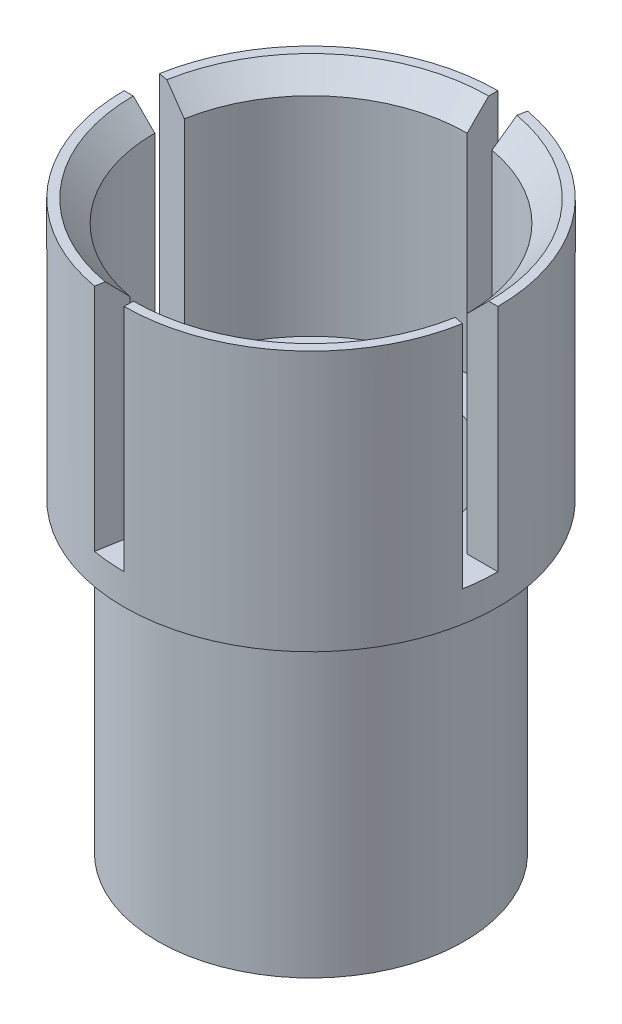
ISO-10303-21;
HEADER;
FILE_DESCRIPTION(('STEP AP214'),'2;1');
FILE_NAME('part.step','',(''),(''),'','','');
FILE_SCHEMA(('AUTOMOTIVE_DESIGN { 1 0 10303 214 1 1 1 1 }'));
ENDSEC;
DATA;
#1=APPLICATION_CONTEXT('core data for automotive mechanical design processes');
#2=APPLICATION_PROTOCOL_DEFINITION('international standard','automotive_design',2000,#1);
#3=PRODUCT_CONTEXT('',#1,'mechanical');
#4=PRODUCT('Part','Part','',(#3));
#5=PRODUCT_RELATED_PRODUCT_CATEGORY('part','',(#4));
#6=PRODUCT_DEFINITION_FORMATION('','',#4);
#7=PRODUCT_DEFINITION_CONTEXT('part definition',#1,'design');
#8=PRODUCT_DEFINITION('design','',#6,#7);
#9=PRODUCT_DEFINITION_SHAPE('','',#8);
#10=(LENGTH_UNIT() NAMED_UNIT(*) SI_UNIT(.MILLI.,.METRE.));
#11=(NAMED_UNIT(*) PLANE_ANGLE_UNIT() SI_UNIT($,.RADIAN.));
#12=(NAMED_UNIT(*) SI_UNIT($,.STERADIAN.) SOLID_ANGLE_UNIT());
#13=UNCERTAINTY_MEASURE_WITH_UNIT(LENGTH_MEASURE(1.E-05),#10,'distance_accuracy_value','');
#14=(GEOMETRIC_REPRESENTATION_CONTEXT(3) GLOBAL_UNCERTAINTY_ASSIGNED_CONTEXT((#13)) GLOBAL_UNIT_ASSIGNED_CONTEXT((#10,
#11,#12)) REPRESENTATION_CONTEXT('',''));
#15=CARTESIAN_POINT('',(0.,0.,0.));
#16=DIRECTION('',(0.,0.,1.));
#17=DIRECTION('',(1.,0.,0.));
#18=AXIS2_PLACEMENT_3D('',#15,#16,#17);
#19=CARTESIAN_POINT('',(0.,46.99,0.));
#20=DIRECTION('',(0.,1.,0.));
#21=DIRECTION('',(0.,0.,1.));
#22=AXIS2_PLACEMENT_3D('',#19,#20,#21);
#23=PLANE('',#22);
#24=CARTESIAN_POINT('',(0.,46.99,0.));
#25=DIRECTION('',(0.,1.,0.));
#26=DIRECTION('',(0.,0.,1.));
#27=AXIS2_PLACEMENT_3D('',#24,#25,#26);
#28=CIRCLE('',#27,14.732);
#29=CARTESIAN_POINT('',(2.55818495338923,46.99,-14.5081878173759));
#30=VERTEX_POINT('',#29);
#31=CARTESIAN_POINT('',(14.732,46.99,1.54309509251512E-13));
#32=VERTEX_POINT('',#31);
#33=EDGE_CURVE('E245',#30,#32,#28,.F.);
#34=ORIENTED_EDGE('',*,*,#33,.T.);
#35=DIRECTION('',(1.,0.,0.));
#36=VECTOR('',#35,1.);
#37=CARTESIAN_POINT('',(0.,46.99,0.));
#38=LINE('',#37,#36);
#39=CARTESIAN_POINT('',(15.494,46.99,1.62291035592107E-13));
#40=VERTEX_POINT('',#39);
#41=EDGE_CURVE('E47',#32,#40,#38,.T.);
#42=ORIENTED_EDGE('',*,*,#41,.T.);
#43=CARTESIAN_POINT('',(0.,46.99,0.));
#44=DIRECTION('',(0.,1.,0.));
#45=DIRECTION('',(0.,0.,1.));
#46=AXIS2_PLACEMENT_3D('',#43,#44,#45);
#47=CIRCLE('',#46,15.494);
#48=CARTESIAN_POINT('',(2.69050486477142,46.99,-15.2586113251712));
#49=VERTEX_POINT('',#48);
#50=EDGE_CURVE('E204',#40,#49,#47,.T.);
#51=ORIENTED_EDGE('',*,*,#50,.T.);
#52=DIRECTION('',(0.173648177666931,0.,-0.984807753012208));
#53=VECTOR('',#52,1.);
#54=CARTESIAN_POINT('',(0.,46.99,0.));
#55=LINE('',#54,#53);
#56=EDGE_CURVE('E250',#30,#49,#55,.T.);
#57=ORIENTED_EDGE('',*,*,#56,.F.);
#58=EDGE_LOOP('',(#34,#42,#51,#57));
#59=FACE_BOUND('',#58,.T.);
#60=ADVANCED_FACE('F32',(#59),#23,.T.);
#61=CARTESIAN_POINT('',(0.,27.94,0.));
#62=DIRECTION('',(0.,1.,0.));
#63=DIRECTION('',(0.,0.,1.));
#64=AXIS2_PLACEMENT_3D('',#61,#62,#63);
#65=CYLINDRICAL_SURFACE('',#64,12.954);
#66=DIRECTION('',(0.,1.,0.));
#67=VECTOR('',#66,1.);
#68=CARTESIAN_POINT('',(12.954,27.94,1.35685947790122E-13));
#69=LINE('',#68,#67);
#70=CARTESIAN_POINT('',(12.954,27.94,1.35685947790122E-13));
#71=VERTEX_POINT('',#70);
#72=CARTESIAN_POINT('',(12.954,45.212,1.35685947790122E-13));
#73=VERTEX_POINT('',#72);
#74=EDGE_CURVE('E179',#71,#73,#69,.T.);
#75=ORIENTED_EDGE('',*,*,#74,.T.);
#76=CARTESIAN_POINT('',(0.,45.212,0.));
#77=DIRECTION('',(0.,1.,0.));
#78=DIRECTION('',(0.,0.,1.));
#79=AXIS2_PLACEMENT_3D('',#76,#77,#78);
#80=CIRCLE('',#79,12.954);
#81=CARTESIAN_POINT('',(2.24943849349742,45.212,-12.7571996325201));
#82=VERTEX_POINT('',#81);
#83=EDGE_CURVE('E222',#73,#82,#80,.T.);
#84=ORIENTED_EDGE('',*,*,#83,.T.);
#85=DIRECTION('',(0.,1.,0.));
#86=VECTOR('',#85,1.);
#87=CARTESIAN_POINT('',(2.24943849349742,27.94,-12.7571996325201));
#88=LINE('',#87,#86);
#89=CARTESIAN_POINT('',(2.24943849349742,27.94,-12.7571996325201));
#90=VERTEX_POINT('',#89);
#91=EDGE_CURVE('E190',#90,#82,#88,.T.);
#92=ORIENTED_EDGE('',*,*,#91,.F.);
#93=CARTESIAN_POINT('',(0.,27.94,0.));
#94=DIRECTION('',(0.,1.,0.));
#95=DIRECTION('',(0.,0.,1.));
#96=AXIS2_PLACEMENT_3D('',#93,#94,#95);
#97=CIRCLE('',#96,12.954);
#98=EDGE_CURVE('E173',#71,#90,#97,.T.);
#99=ORIENTED_EDGE('',*,*,#98,.F.);
#100=EDGE_LOOP('',(#75,#84,#92,#99));
#101=FACE_BOUND('',#100,.T.);
#102=ADVANCED_FACE('F188',(#101),#65,.F.);
#103=CARTESIAN_POINT('',(0.,45.212,0.));
#104=DIRECTION('',(0.,1.,0.));
#105=DIRECTION('',(0.,0.,1.));
#106=AXIS2_PLACEMENT_3D('',#103,#104,#105);
#107=CONICAL_SURFACE('',#106,12.954,0.78539816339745);
#108=ORIENTED_EDGE('',*,*,#83,.F.);
#109=DIRECTION('',(0.707106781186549,0.707106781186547,0.));
#110=VECTOR('',#109,1.);
#111=CARTESIAN_POINT('',(0.,32.258,0.));
#112=LINE('',#111,#110);
#113=EDGE_CURVE('E40',#73,#32,#112,.T.);
#114=ORIENTED_EDGE('',*,*,#113,.T.);
#115=ORIENTED_EDGE('',*,*,#33,.F.);
#116=DIRECTION('',(0.122787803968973,0.707106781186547,-0.69636424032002));
#117=VECTOR('',#116,1.);
#118=CARTESIAN_POINT('',(0.,32.258,0.));
#119=LINE('',#118,#117);
#120=EDGE_CURVE('E239',#82,#30,#119,.T.);
#121=ORIENTED_EDGE('',*,*,#120,.F.);
#122=EDGE_LOOP('',(#108,#114,#115,#121));
#123=FACE_BOUND('',#122,.T.);
#124=ADVANCED_FACE('F243',(#123),#107,.F.);
#125=CARTESIAN_POINT('',(-14.5081878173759,46.99,-2.55818495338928));
#126=VERTEX_POINT('',#125);
#127=CARTESIAN_POINT('',(0.,46.99,-14.732));
#128=VERTEX_POINT('',#127);
#129=EDGE_CURVE('E227',#126,#128,#28,.F.);
#130=ORIENTED_EDGE('',*,*,#129,.T.);
#131=DIRECTION('',(0.,0.,-1.));
#132=VECTOR('',#131,1.);
#133=CARTESIAN_POINT('',(0.,46.99,0.));
#134=LINE('',#133,#132);
#135=CARTESIAN_POINT('',(0.,46.99,-15.494));
#136=VERTEX_POINT('',#135);
#137=EDGE_CURVE('E55',#128,#136,#134,.T.);
#138=ORIENTED_EDGE('',*,*,#137,.T.);
#139=CARTESIAN_POINT('',(-15.2586113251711,46.99,-2.69050486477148));
#140=VERTEX_POINT('',#139);
#141=EDGE_CURVE('E368',#136,#140,#47,.T.);
#142=ORIENTED_EDGE('',*,*,#141,.T.);
#143=DIRECTION('',(-0.984807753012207,0.,-0.173648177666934));
#144=VECTOR('',#143,1.);
#145=CARTESIAN_POINT('',(0.,46.99,0.));
#146=LINE('',#145,#144);
#147=EDGE_CURVE('E351',#126,#140,#146,.T.);
#148=ORIENTED_EDGE('',*,*,#147,.F.);
#149=EDGE_LOOP('',(#130,#138,#142,#148));
#150=FACE_BOUND('',#149,.T.);
#151=ADVANCED_FACE('F400',(#150),#23,.T.);
#152=DIRECTION('',(0.,1.,0.));
#153=VECTOR('',#152,1.);
#154=CARTESIAN_POINT('',(0.,27.94,-12.954));
#155=LINE('',#154,#153);
#156=CARTESIAN_POINT('',(0.,27.94,-12.954));
#157=VERTEX_POINT('',#156);
#158=CARTESIAN_POINT('',(0.,45.212,-12.954));
#159=VERTEX_POINT('',#158);
#160=EDGE_CURVE('E326',#157,#159,#155,.T.);
#161=ORIENTED_EDGE('',*,*,#160,.T.);
#162=CARTESIAN_POINT('',(-12.7571996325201,45.212,-2.24943849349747));
#163=VERTEX_POINT('',#162);
#164=EDGE_CURVE('E314',#159,#163,#80,.T.);
#165=ORIENTED_EDGE('',*,*,#164,.T.);
#166=DIRECTION('',(0.,1.,0.));
#167=VECTOR('',#166,1.);
#168=CARTESIAN_POINT('',(-12.7571996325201,27.94,-2.24943849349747));
#169=LINE('',#168,#167);
#170=CARTESIAN_POINT('',(-12.7571996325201,27.94,-2.24943849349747));
#171=VERTEX_POINT('',#170);
#172=EDGE_CURVE('E344',#171,#163,#169,.T.);
#173=ORIENTED_EDGE('',*,*,#172,.F.);
#174=EDGE_CURVE('E192',#157,#171,#97,.T.);
#175=ORIENTED_EDGE('',*,*,#174,.F.);
#176=EDGE_LOOP('',(#161,#165,#173,#175));
#177=FACE_BOUND('',#176,.T.);
#178=ADVANCED_FACE('F405',(#177),#65,.F.);
#179=ORIENTED_EDGE('',*,*,#164,.F.);
#180=DIRECTION('',(0.,0.707106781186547,-0.707106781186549));
#181=VECTOR('',#180,1.);
#182=CARTESIAN_POINT('',(0.,32.258,0.));
#183=LINE('',#182,#181);
#184=EDGE_CURVE('E237',#159,#128,#183,.T.);
#185=ORIENTED_EDGE('',*,*,#184,.T.);
#186=ORIENTED_EDGE('',*,*,#129,.F.);
#187=DIRECTION('',(-0.69636424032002,0.707106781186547,-0.122787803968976));
#188=VECTOR('',#187,1.);
#189=CARTESIAN_POINT('',(0.,32.258,0.));
#190=LINE('',#189,#188);
#191=EDGE_CURVE('E235',#163,#126,#190,.T.);
#192=ORIENTED_EDGE('',*,*,#191,.F.);
#193=EDGE_LOOP('',(#179,#185,#186,#192));
#194=FACE_BOUND('',#193,.T.);
#195=ADVANCED_FACE('F418',(#194),#107,.F.);
#196=CARTESIAN_POINT('',(-2.55818495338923,46.99,14.5081878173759));
#197=VERTEX_POINT('',#196);
#198=CARTESIAN_POINT('',(-14.732,46.99,0.));
#199=VERTEX_POINT('',#198);
#200=EDGE_CURVE('E223',#197,#199,#28,.F.);
#201=ORIENTED_EDGE('',*,*,#200,.T.);
#202=DIRECTION('',(-1.,0.,0.));
#203=VECTOR('',#202,1.);
#204=CARTESIAN_POINT('',(0.,46.99,0.));
#205=LINE('',#204,#203);
#206=CARTESIAN_POINT('',(-15.494,46.99,0.));
#207=VERTEX_POINT('',#206);
#208=EDGE_CURVE('E346',#199,#207,#205,.T.);
#209=ORIENTED_EDGE('',*,*,#208,.T.);
#210=CARTESIAN_POINT('',(-2.69050486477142,46.99,15.2586113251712));
#211=VERTEX_POINT('',#210);
#212=EDGE_CURVE('E205',#207,#211,#47,.T.);
#213=ORIENTED_EDGE('',*,*,#212,.T.);
#214=DIRECTION('',(-0.173648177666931,0.,0.984807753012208));
#215=VECTOR('',#214,1.);
#216=CARTESIAN_POINT('',(0.,46.99,0.));
#217=LINE('',#216,#215);
#218=EDGE_CURVE('E291',#197,#211,#217,.T.);
#219=ORIENTED_EDGE('',*,*,#218,.F.);
#220=EDGE_LOOP('',(#201,#209,#213,#219));
#221=FACE_BOUND('',#220,.T.);
#222=ADVANCED_FACE('F367',(#221),#23,.T.);
#223=DIRECTION('',(0.,1.,0.));
#224=VECTOR('',#223,1.);
#225=CARTESIAN_POINT('',(-12.954,27.94,0.));
#226=LINE('',#225,#224);
#227=CARTESIAN_POINT('',(-12.954,27.94,0.));
#228=VERTEX_POINT('',#227);
#229=CARTESIAN_POINT('',(-12.954,45.212,0.));
#230=VERTEX_POINT('',#229);
#231=EDGE_CURVE('E312',#228,#230,#226,.T.);
#232=ORIENTED_EDGE('',*,*,#231,.T.);
#233=CARTESIAN_POINT('',(-2.24943849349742,45.212,12.7571996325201));
#234=VERTEX_POINT('',#233);
#235=EDGE_CURVE('E211',#230,#234,#80,.T.);
#236=ORIENTED_EDGE('',*,*,#235,.T.);
#237=DIRECTION('',(0.,1.,0.));
#238=VECTOR('',#237,1.);
#239=CARTESIAN_POINT('',(-2.24943849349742,27.94,12.7571996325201));
#240=LINE('',#239,#238);
#241=CARTESIAN_POINT('',(-2.24943849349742,27.94,12.7571996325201));
#242=VERTEX_POINT('',#241);
#243=EDGE_CURVE('E270',#242,#234,#240,.T.);
#244=ORIENTED_EDGE('',*,*,#243,.F.);
#245=EDGE_CURVE('E195',#228,#242,#97,.T.);
#246=ORIENTED_EDGE('',*,*,#245,.F.);
#247=EDGE_LOOP('',(#232,#236,#244,#246));
#248=FACE_BOUND('',#247,.T.);
#249=ADVANCED_FACE('F309',(#248),#65,.F.);
#250=ORIENTED_EDGE('',*,*,#235,.F.);
#251=DIRECTION('',(-0.707106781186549,0.707106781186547,0.));
#252=VECTOR('',#251,1.);
#253=CARTESIAN_POINT('',(0.,32.258,0.));
#254=LINE('',#253,#252);
#255=EDGE_CURVE('E232',#230,#199,#254,.T.);
#256=ORIENTED_EDGE('',*,*,#255,.T.);
#257=ORIENTED_EDGE('',*,*,#200,.F.);
#258=DIRECTION('',(-0.122787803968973,0.707106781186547,0.69636424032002));
#259=VECTOR('',#258,1.);
#260=CARTESIAN_POINT('',(0.,32.258,0.));
#261=LINE('',#260,#259);
#262=EDGE_CURVE('E230',#234,#197,#261,.T.);
#263=ORIENTED_EDGE('',*,*,#262,.F.);
#264=EDGE_LOOP('',(#250,#256,#257,#263));
#265=FACE_BOUND('',#264,.T.);
#266=ADVANCED_FACE('F364',(#265),#107,.F.);
#267=CARTESIAN_POINT('',(0.,25.4,0.));
#268=DIRECTION('',(0.,-1.,0.));
#269=DIRECTION('',(0.,0.,-1.));
#270=AXIS2_PLACEMENT_3D('',#267,#268,#269);
#271=CYLINDRICAL_SURFACE('',#270,12.7);
#272=CARTESIAN_POINT('',(0.,25.4,0.));
#273=DIRECTION('',(0.,1.,0.));
#274=DIRECTION('',(0.,0.,1.));
#275=AXIS2_PLACEMENT_3D('',#272,#273,#274);
#276=CIRCLE('',#275,12.7);
#277=CARTESIAN_POINT('',(0.,25.4,12.7));
#278=VERTEX_POINT('',#277);
#279=EDGE_CURVE('E208',#278,#278,#276,.T.);
#280=ORIENTED_EDGE('',*,*,#279,.F.);
#281=EDGE_LOOP('',(#280));
#282=FACE_BOUND('',#281,.T.);
#283=CARTESIAN_POINT('',(0.,0.,0.));
#284=DIRECTION('',(0.,1.,0.));
#285=DIRECTION('',(0.,0.,1.));
#286=AXIS2_PLACEMENT_3D('',#283,#284,#285);
#287=CIRCLE('',#286,12.7);
#288=CARTESIAN_POINT('',(0.,0.,12.7));
#289=VERTEX_POINT('',#288);
#290=EDGE_CURVE('E203',#289,#289,#287,.T.);
#291=ORIENTED_EDGE('',*,*,#290,.T.);
#292=EDGE_LOOP('',(#291));
#293=FACE_BOUND('',#292,.T.);
#294=ADVANCED_FACE('F428',(#282,#293),#271,.T.);
#295=CARTESIAN_POINT('',(0.,0.,0.));
#296=DIRECTION('',(0.,1.,0.));
#297=DIRECTION('',(0.,0.,1.));
#298=AXIS2_PLACEMENT_3D('',#295,#296,#297);
#299=PLANE('',#298);
#300=CARTESIAN_POINT('',(0.,0.,0.));
#301=DIRECTION('',(0.,-1.,0.));
#302=DIRECTION('',(0.,0.,-1.));
#303=AXIS2_PLACEMENT_3D('',#300,#301,#302);
#304=CIRCLE('',#303,10.16);
#305=CARTESIAN_POINT('',(0.,0.,-10.16));
#306=VERTEX_POINT('',#305);
#307=EDGE_CURVE('E198',#306,#306,#304,.T.);
#308=ORIENTED_EDGE('',*,*,#307,.F.);
#309=EDGE_LOOP('',(#308));
#310=FACE_BOUND('',#309,.T.);
#311=ORIENTED_EDGE('',*,*,#290,.F.);
#312=EDGE_LOOP('',(#311));
#313=FACE_BOUND('',#312,.T.);
#314=ADVANCED_FACE('F415',(#310,#313),#299,.F.);
#315=CARTESIAN_POINT('',(0.,46.99,0.));
#316=DIRECTION('',(0.,-1.,0.));
#317=DIRECTION('',(0.,0.,-1.));
#318=AXIS2_PLACEMENT_3D('',#315,#316,#317);
#319=CYLINDRICAL_SURFACE('',#318,15.494);
#320=CARTESIAN_POINT('',(0.,27.94,0.));
#321=DIRECTION('',(0.,-1.,0.));
#322=DIRECTION('',(0.,0.,-1.));
#323=AXIS2_PLACEMENT_3D('',#320,#321,#322);
#324=CIRCLE('',#323,15.494);
#325=CARTESIAN_POINT('',(15.494,27.94,1.62291035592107E-13));
#326=VERTEX_POINT('',#325);
#327=CARTESIAN_POINT('',(15.2586113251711,27.94,2.69050486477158));
#328=VERTEX_POINT('',#327);
#329=EDGE_CURVE('E177',#326,#328,#324,.T.);
#330=ORIENTED_EDGE('',*,*,#329,.T.);
#331=DIRECTION('',(0.,-1.,0.));
#332=VECTOR('',#331,1.);
#333=CARTESIAN_POINT('',(15.2586113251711,46.99,2.69050486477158));
#334=LINE('',#333,#332);
#335=CARTESIAN_POINT('',(15.2586113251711,46.99,2.69050486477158));
#336=VERTEX_POINT('',#335);
#337=EDGE_CURVE('E378',#328,#336,#334,.F.);
#338=ORIENTED_EDGE('',*,*,#337,.T.);
#339=CARTESIAN_POINT('',(0.,46.99,15.494));
#340=VERTEX_POINT('',#339);
#341=EDGE_CURVE('E200',#340,#336,#47,.T.);
#342=ORIENTED_EDGE('',*,*,#341,.F.);
#343=DIRECTION('',(0.,-1.,0.));
#344=VECTOR('',#343,1.);
#345=CARTESIAN_POINT('',(0.,46.99,15.494));
#346=LINE('',#345,#344);
#347=CARTESIAN_POINT('',(0.,27.94,15.494));
#348=VERTEX_POINT('',#347);
#349=EDGE_CURVE('E269',#348,#340,#346,.F.);
#350=ORIENTED_EDGE('',*,*,#349,.F.);
#351=CARTESIAN_POINT('',(0.,27.94,0.));
#352=DIRECTION('',(0.,-1.,0.));
#353=DIRECTION('',(0.,0.,-1.));
#354=AXIS2_PLACEMENT_3D('',#351,#352,#353);
#355=CIRCLE('',#354,15.494);
#356=CARTESIAN_POINT('',(-2.69050486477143,27.94,15.2586113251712));
#357=VERTEX_POINT('',#356);
#358=EDGE_CURVE('E217',#348,#357,#355,.T.);
#359=ORIENTED_EDGE('',*,*,#358,.T.);
#360=DIRECTION('',(0.,-1.,0.));
#361=VECTOR('',#360,1.);
#362=CARTESIAN_POINT('',(-2.69050486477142,46.99,15.2586113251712));
#363=LINE('',#362,#361);
#364=EDGE_CURVE('E294',#357,#211,#363,.F.);
#365=ORIENTED_EDGE('',*,*,#364,.T.);
#366=ORIENTED_EDGE('',*,*,#212,.F.);
#367=DIRECTION('',(0.,-1.,0.));
#368=VECTOR('',#367,1.);
#369=CARTESIAN_POINT('',(-15.494,46.99,0.));
#370=LINE('',#369,#368);
#371=CARTESIAN_POINT('',(-15.494,27.94,0.));
#372=VERTEX_POINT('',#371);
#373=EDGE_CURVE('E349',#372,#207,#370,.F.);
#374=ORIENTED_EDGE('',*,*,#373,.F.);
#375=CARTESIAN_POINT('',(0.,27.94,0.));
#376=DIRECTION('',(0.,-1.,0.));
#377=DIRECTION('',(0.,0.,-1.));
#378=AXIS2_PLACEMENT_3D('',#375,#376,#377);
#379=CIRCLE('',#378,15.494);
#380=CARTESIAN_POINT('',(-15.2586113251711,27.94,-2.69050486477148));
#381=VERTEX_POINT('',#380);
#382=EDGE_CURVE('E284',#372,#381,#379,.T.);
#383=ORIENTED_EDGE('',*,*,#382,.T.);
#384=DIRECTION('',(0.,-1.,0.));
#385=VECTOR('',#384,1.);
#386=CARTESIAN_POINT('',(-15.2586113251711,46.99,-2.69050486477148));
#387=LINE('',#386,#385);
#388=EDGE_CURVE('E354',#381,#140,#387,.F.);
#389=ORIENTED_EDGE('',*,*,#388,.T.);
#390=ORIENTED_EDGE('',*,*,#141,.F.);
#391=DIRECTION('',(0.,-1.,0.));
#392=VECTOR('',#391,1.);
#393=CARTESIAN_POINT('',(0.,46.99,-15.494));
#394=LINE('',#393,#392);
#395=CARTESIAN_POINT('',(0.,27.94,-15.494));
#396=VERTEX_POINT('',#395);
#397=EDGE_CURVE('E324',#396,#136,#394,.F.);
#398=ORIENTED_EDGE('',*,*,#397,.F.);
#399=CARTESIAN_POINT('',(0.,27.94,0.));
#400=DIRECTION('',(0.,-1.,0.));
#401=DIRECTION('',(0.,0.,-1.));
#402=AXIS2_PLACEMENT_3D('',#399,#400,#401);
#403=CIRCLE('',#402,15.494);
#404=CARTESIAN_POINT('',(2.69050486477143,27.94,-15.2586113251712));
#405=VERTEX_POINT('',#404);
#406=EDGE_CURVE('E335',#396,#405,#403,.T.);
#407=ORIENTED_EDGE('',*,*,#406,.T.);
#408=DIRECTION('',(0.,-1.,0.));
#409=VECTOR('',#408,1.);
#410=CARTESIAN_POINT('',(2.69050486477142,46.99,-15.2586113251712));
#411=LINE('',#410,#409);
#412=EDGE_CURVE('E332',#405,#49,#411,.F.);
#413=ORIENTED_EDGE('',*,*,#412,.T.);
#414=ORIENTED_EDGE('',*,*,#50,.F.);
#415=DIRECTION('',(0.,-1.,0.));
#416=VECTOR('',#415,1.);
#417=CARTESIAN_POINT('',(15.494,46.99,1.62291035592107E-13));
#418=LINE('',#417,#416);
#419=EDGE_CURVE('E384',#326,#40,#418,.F.);
#420=ORIENTED_EDGE('',*,*,#419,.F.);
#421=EDGE_LOOP('',(#330,#338,#342,#350,#359,#365,#366,#374,#383,#389,#390,#398,#407,#413,#414,#420));
#422=FACE_BOUND('',#421,.T.);
#423=CARTESIAN_POINT('',(0.,25.4,0.));
#424=DIRECTION('',(0.,1.,0.));
#425=DIRECTION('',(0.,0.,1.));
#426=AXIS2_PLACEMENT_3D('',#423,#424,#425);
#427=CIRCLE('',#426,15.494);
#428=CARTESIAN_POINT('',(0.,25.4,15.494));
#429=VERTEX_POINT('',#428);
#430=EDGE_CURVE('E194',#429,#429,#427,.T.);
#431=ORIENTED_EDGE('',*,*,#430,.T.);
#432=EDGE_LOOP('',(#431));
#433=FACE_BOUND('',#432,.T.);
#434=ADVANCED_FACE('F298',(#422,#433),#319,.T.);
#435=DIRECTION('',(0.984807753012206,0.,0.173648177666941));
#436=VECTOR('',#435,1.);
#437=CARTESIAN_POINT('',(0.,46.99,0.));
#438=LINE('',#437,#436);
#439=CARTESIAN_POINT('',(14.5081878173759,46.99,2.55818495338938));
#440=VERTEX_POINT('',#439);
#441=EDGE_CURVE('E260',#440,#336,#438,.T.);
#442=ORIENTED_EDGE('',*,*,#441,.F.);
#443=CARTESIAN_POINT('',(0.,46.99,14.732));
#444=VERTEX_POINT('',#443);
#445=EDGE_CURVE('E221',#440,#444,#28,.F.);
#446=ORIENTED_EDGE('',*,*,#445,.T.);
#447=DIRECTION('',(0.,0.,1.));
#448=VECTOR('',#447,1.);
#449=CARTESIAN_POINT('',(0.,46.99,0.));
#450=LINE('',#449,#448);
#451=EDGE_CURVE('E258',#444,#340,#450,.T.);
#452=ORIENTED_EDGE('',*,*,#451,.T.);
#453=ORIENTED_EDGE('',*,*,#341,.T.);
#454=EDGE_LOOP('',(#442,#446,#452,#453));
#455=FACE_BOUND('',#454,.T.);
#456=ADVANCED_FACE('F257',(#455),#23,.T.);
#457=CARTESIAN_POINT('',(0.,25.4,0.));
#458=DIRECTION('',(0.,1.,0.));
#459=DIRECTION('',(0.,0.,1.));
#460=AXIS2_PLACEMENT_3D('',#457,#458,#459);
#461=PLANE('',#460);
#462=ORIENTED_EDGE('',*,*,#279,.T.);
#463=EDGE_LOOP('',(#462));
#464=FACE_BOUND('',#463,.T.);
#465=ORIENTED_EDGE('',*,*,#430,.F.);
#466=EDGE_LOOP('',(#465));
#467=FACE_BOUND('',#466,.T.);
#468=ADVANCED_FACE('F409',(#464,#467),#461,.F.);
#469=CARTESIAN_POINT('',(0.,45.212,12.954));
#470=VERTEX_POINT('',#469);
#471=CARTESIAN_POINT('',(12.7571996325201,45.212,2.24943849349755));
#472=VERTEX_POINT('',#471);
#473=EDGE_CURVE('E218',#470,#472,#80,.T.);
#474=ORIENTED_EDGE('',*,*,#473,.T.);
#475=DIRECTION('',(0.,1.,0.));
#476=VECTOR('',#475,1.);
#477=CARTESIAN_POINT('',(12.7571996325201,27.94,2.24943849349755));
#478=LINE('',#477,#476);
#479=CARTESIAN_POINT('',(12.7571996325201,27.94,2.24943849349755));
#480=VERTEX_POINT('',#479);
#481=EDGE_CURVE('E277',#480,#472,#478,.T.);
#482=ORIENTED_EDGE('',*,*,#481,.F.);
#483=CARTESIAN_POINT('',(0.,27.94,12.954));
#484=VERTEX_POINT('',#483);
#485=EDGE_CURVE('E191',#484,#480,#97,.T.);
#486=ORIENTED_EDGE('',*,*,#485,.F.);
#487=DIRECTION('',(0.,1.,0.));
#488=VECTOR('',#487,1.);
#489=CARTESIAN_POINT('',(0.,27.94,12.954));
#490=LINE('',#489,#488);
#491=EDGE_CURVE('E278',#484,#470,#490,.T.);
#492=ORIENTED_EDGE('',*,*,#491,.T.);
#493=EDGE_LOOP('',(#474,#482,#486,#492));
#494=FACE_BOUND('',#493,.T.);
#495=ADVANCED_FACE('F275',(#494),#65,.F.);
#496=CARTESIAN_POINT('',(0.,27.94,0.));
#497=DIRECTION('',(0.,1.,0.));
#498=DIRECTION('',(0.,0.,1.));
#499=AXIS2_PLACEMENT_3D('',#496,#497,#498);
#500=PLANE('',#499);
#501=CARTESIAN_POINT('',(0.,27.94,0.));
#502=DIRECTION('',(0.,1.,0.));
#503=DIRECTION('',(0.,0.,1.));
#504=AXIS2_PLACEMENT_3D('',#501,#502,#503);
#505=CIRCLE('',#504,10.16);
#506=CARTESIAN_POINT('',(0.,27.94,10.16));
#507=VERTEX_POINT('',#506);
#508=EDGE_CURVE('E214',#507,#507,#505,.T.);
#509=ORIENTED_EDGE('',*,*,#508,.F.);
#510=EDGE_LOOP('',(#509));
#511=FACE_BOUND('',#510,.T.);
#512=ORIENTED_EDGE('',*,*,#485,.T.);
#513=DIRECTION('',(-0.984807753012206,0.,-0.173648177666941));
#514=VECTOR('',#513,1.);
#515=CARTESIAN_POINT('',(12.7571996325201,27.94,2.24943849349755));
#516=LINE('',#515,#514);
#517=EDGE_CURVE('E185',#328,#480,#516,.T.);
#518=ORIENTED_EDGE('',*,*,#517,.F.);
#519=ORIENTED_EDGE('',*,*,#329,.F.);
#520=DIRECTION('',(-1.,0.,0.));
#521=VECTOR('',#520,1.);
#522=CARTESIAN_POINT('',(12.954,27.94,1.35685947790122E-13));
#523=LINE('',#522,#521);
#524=EDGE_CURVE('E167',#326,#71,#523,.T.);
#525=ORIENTED_EDGE('',*,*,#524,.T.);
#526=ORIENTED_EDGE('',*,*,#98,.T.);
#527=DIRECTION('',(-0.173648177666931,0.,0.984807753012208));
#528=VECTOR('',#527,1.);
#529=CARTESIAN_POINT('',(2.24943849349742,27.94,-12.7571996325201));
#530=LINE('',#529,#528);
#531=EDGE_CURVE('E322',#405,#90,#530,.T.);
#532=ORIENTED_EDGE('',*,*,#531,.F.);
#533=ORIENTED_EDGE('',*,*,#406,.F.);
#534=DIRECTION('',(0.,0.,1.));
#535=VECTOR('',#534,1.);
#536=CARTESIAN_POINT('',(0.,27.94,-12.954));
#537=LINE('',#536,#535);
#538=EDGE_CURVE('E373',#396,#157,#537,.T.);
#539=ORIENTED_EDGE('',*,*,#538,.T.);
#540=ORIENTED_EDGE('',*,*,#174,.T.);
#541=DIRECTION('',(0.984807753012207,0.,0.173648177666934));
#542=VECTOR('',#541,1.);
#543=CARTESIAN_POINT('',(-12.7571996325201,27.94,-2.24943849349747));
#544=LINE('',#543,#542);
#545=EDGE_CURVE('E341',#381,#171,#544,.T.);
#546=ORIENTED_EDGE('',*,*,#545,.F.);
#547=ORIENTED_EDGE('',*,*,#382,.F.);
#548=DIRECTION('',(1.,0.,0.));
#549=VECTOR('',#548,1.);
#550=CARTESIAN_POINT('',(-12.954,27.94,0.));
#551=LINE('',#550,#549);
#552=EDGE_CURVE('E338',#372,#228,#551,.T.);
#553=ORIENTED_EDGE('',*,*,#552,.T.);
#554=ORIENTED_EDGE('',*,*,#245,.T.);
#555=DIRECTION('',(0.173648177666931,0.,-0.984807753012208));
#556=VECTOR('',#555,1.);
#557=CARTESIAN_POINT('',(-2.24943849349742,27.94,12.7571996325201));
#558=LINE('',#557,#556);
#559=EDGE_CURVE('E279',#357,#242,#558,.T.);
#560=ORIENTED_EDGE('',*,*,#559,.F.);
#561=ORIENTED_EDGE('',*,*,#358,.F.);
#562=DIRECTION('',(0.,0.,-1.));
#563=VECTOR('',#562,1.);
#564=CARTESIAN_POINT('',(0.,27.94,12.954));
#565=LINE('',#564,#563);
#566=EDGE_CURVE('E280',#348,#484,#565,.T.);
#567=ORIENTED_EDGE('',*,*,#566,.T.);
#568=EDGE_LOOP('',(#512,#518,#519,#525,#526,#532,#533,#539,#540,#546,#547,#553,#554,#560,#561,#567));
#569=FACE_BOUND('',#568,.T.);
#570=ADVANCED_FACE('F170',(#511,#569),#500,.T.);
#571=CARTESIAN_POINT('',(0.,25.4,0.));
#572=DIRECTION('',(0.,-1.,0.));
#573=DIRECTION('',(0.,0.,-1.));
#574=AXIS2_PLACEMENT_3D('',#571,#572,#573);
#575=CYLINDRICAL_SURFACE('',#574,10.16);
#576=ORIENTED_EDGE('',*,*,#307,.T.);
#577=EDGE_LOOP('',(#576));
#578=FACE_BOUND('',#577,.T.);
#579=ORIENTED_EDGE('',*,*,#508,.T.);
#580=EDGE_LOOP('',(#579));
#581=FACE_BOUND('',#580,.T.);
#582=ADVANCED_FACE('F433',(#578,#581),#575,.F.);
#583=DIRECTION('',(0.696364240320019,0.707106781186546,0.122787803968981));
#584=VECTOR('',#583,1.);
#585=CARTESIAN_POINT('',(0.,32.258,0.));
#586=LINE('',#585,#584);
#587=EDGE_CURVE('E11',#472,#440,#586,.T.);
#588=ORIENTED_EDGE('',*,*,#587,.F.);
#589=ORIENTED_EDGE('',*,*,#473,.F.);
#590=DIRECTION('',(0.,0.707106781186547,0.707106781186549));
#591=VECTOR('',#590,1.);
#592=CARTESIAN_POINT('',(0.,32.258,0.));
#593=LINE('',#592,#591);
#594=EDGE_CURVE('E226',#470,#444,#593,.T.);
#595=ORIENTED_EDGE('',*,*,#594,.T.);
#596=ORIENTED_EDGE('',*,*,#445,.F.);
#597=EDGE_LOOP('',(#588,#589,#595,#596));
#598=FACE_BOUND('',#597,.T.);
#599=ADVANCED_FACE('F34',(#598),#107,.F.);
#600=CARTESIAN_POINT('',(0.,0.,0.));
#601=DIRECTION('',(-0.984807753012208,0.,-0.173648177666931));
#602=DIRECTION('',(-0.173648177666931,0.,0.984807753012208));
#603=AXIS2_PLACEMENT_3D('',#600,#601,#602);
#604=PLANE('',#603);
#605=ORIENTED_EDGE('',*,*,#559,.T.);
#606=ORIENTED_EDGE('',*,*,#243,.T.);
#607=ORIENTED_EDGE('',*,*,#262,.T.);
#608=ORIENTED_EDGE('',*,*,#218,.T.);
#609=ORIENTED_EDGE('',*,*,#364,.F.);
#610=EDGE_LOOP('',(#605,#606,#607,#608,#609));
#611=FACE_BOUND('',#610,.T.);
#612=ADVANCED_FACE('F305',(#611),#604,.F.);
#613=CARTESIAN_POINT('',(0.,0.,0.));
#614=DIRECTION('',(-1.,0.,0.));
#615=DIRECTION('',(0.,0.,1.));
#616=AXIS2_PLACEMENT_3D('',#613,#614,#615);
#617=PLANE('',#616);
#618=ORIENTED_EDGE('',*,*,#349,.T.);
#619=ORIENTED_EDGE('',*,*,#451,.F.);
#620=ORIENTED_EDGE('',*,*,#594,.F.);
#621=ORIENTED_EDGE('',*,*,#491,.F.);
#622=ORIENTED_EDGE('',*,*,#566,.F.);
#623=EDGE_LOOP('',(#618,#619,#620,#621,#622));
#624=FACE_BOUND('',#623,.T.);
#625=ADVANCED_FACE('F264',(#624),#617,.T.);
#626=CARTESIAN_POINT('',(0.,0.,0.));
#627=DIRECTION('',(0.173648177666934,0.,-0.984807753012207));
#628=DIRECTION('',(-0.984807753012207,0.,-0.173648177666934));
#629=AXIS2_PLACEMENT_3D('',#626,#627,#628);
#630=PLANE('',#629);
#631=ORIENTED_EDGE('',*,*,#545,.T.);
#632=ORIENTED_EDGE('',*,*,#172,.T.);
#633=ORIENTED_EDGE('',*,*,#191,.T.);
#634=ORIENTED_EDGE('',*,*,#147,.T.);
#635=ORIENTED_EDGE('',*,*,#388,.F.);
#636=EDGE_LOOP('',(#631,#632,#633,#634,#635));
#637=FACE_BOUND('',#636,.T.);
#638=ADVANCED_FACE('F471',(#637),#630,.F.);
#639=CARTESIAN_POINT('',(0.,0.,0.));
#640=DIRECTION('',(0.,0.,-1.));
#641=DIRECTION('',(-1.,0.,0.));
#642=AXIS2_PLACEMENT_3D('',#639,#640,#641);
#643=PLANE('',#642);
#644=ORIENTED_EDGE('',*,*,#373,.T.);
#645=ORIENTED_EDGE('',*,*,#208,.F.);
#646=ORIENTED_EDGE('',*,*,#255,.F.);
#647=ORIENTED_EDGE('',*,*,#231,.F.);
#648=ORIENTED_EDGE('',*,*,#552,.F.);
#649=EDGE_LOOP('',(#644,#645,#646,#647,#648));
#650=FACE_BOUND('',#649,.T.);
#651=ADVANCED_FACE('F362',(#650),#643,.T.);
#652=CARTESIAN_POINT('',(0.,0.,0.));
#653=DIRECTION('',(0.984807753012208,0.,0.173648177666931));
#654=DIRECTION('',(0.173648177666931,0.,-0.984807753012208));
#655=AXIS2_PLACEMENT_3D('',#652,#653,#654);
#656=PLANE('',#655);
#657=ORIENTED_EDGE('',*,*,#531,.T.);
#658=ORIENTED_EDGE('',*,*,#91,.T.);
#659=ORIENTED_EDGE('',*,*,#120,.T.);
#660=ORIENTED_EDGE('',*,*,#56,.T.);
#661=ORIENTED_EDGE('',*,*,#412,.F.);
#662=EDGE_LOOP('',(#657,#658,#659,#660,#661));
#663=FACE_BOUND('',#662,.T.);
#664=ADVANCED_FACE('F321',(#663),#656,.F.);
#665=CARTESIAN_POINT('',(0.,0.,0.));
#666=DIRECTION('',(1.,0.,0.));
#667=DIRECTION('',(0.,0.,-1.));
#668=AXIS2_PLACEMENT_3D('',#665,#666,#667);
#669=PLANE('',#668);
#670=ORIENTED_EDGE('',*,*,#397,.T.);
#671=ORIENTED_EDGE('',*,*,#137,.F.);
#672=ORIENTED_EDGE('',*,*,#184,.F.);
#673=ORIENTED_EDGE('',*,*,#160,.F.);
#674=ORIENTED_EDGE('',*,*,#538,.F.);
#675=EDGE_LOOP('',(#670,#671,#672,#673,#674));
#676=FACE_BOUND('',#675,.T.);
#677=ADVANCED_FACE('F375',(#676),#669,.T.);
#678=CARTESIAN_POINT('',(0.,0.,0.));
#679=DIRECTION('',(-0.173648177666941,0.,0.984807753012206));
#680=DIRECTION('',(0.984807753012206,0.,0.173648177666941));
#681=AXIS2_PLACEMENT_3D('',#678,#679,#680);
#682=PLANE('',#681);
#683=ORIENTED_EDGE('',*,*,#517,.T.);
#684=ORIENTED_EDGE('',*,*,#481,.T.);
#685=ORIENTED_EDGE('',*,*,#587,.T.);
#686=ORIENTED_EDGE('',*,*,#441,.T.);
#687=ORIENTED_EDGE('',*,*,#337,.F.);
#688=EDGE_LOOP('',(#683,#684,#685,#686,#687));
#689=FACE_BOUND('',#688,.T.);
#690=ADVANCED_FACE('F389',(#689),#682,.F.);
#691=CARTESIAN_POINT('',(0.,0.,0.));
#692=DIRECTION('',(0.,0.,1.));
#693=DIRECTION('',(1.,0.,0.));
#694=AXIS2_PLACEMENT_3D('',#691,#692,#693);
#695=PLANE('',#694);
#696=ORIENTED_EDGE('',*,*,#419,.T.);
#697=ORIENTED_EDGE('',*,*,#41,.F.);
#698=ORIENTED_EDGE('',*,*,#113,.F.);
#699=ORIENTED_EDGE('',*,*,#74,.F.);
#700=ORIENTED_EDGE('',*,*,#524,.F.);
#701=EDGE_LOOP('',(#696,#697,#698,#699,#700));
#702=FACE_BOUND('',#701,.T.);
#703=ADVANCED_FACE('F182',(#702),#695,.T.);
#704=CLOSED_SHELL('',(#60,#102,#124,#151,#178,#195,#222,#249,#266,#294,#314,#434,#456,#468,#495,
#570,#582,#599,#612,#625,#638,#651,#664,#677,#690,#703));
#705=MANIFOLD_SOLID_BREP('B2',#704);
#706=ADVANCED_BREP_SHAPE_REPRESENTATION('',(#18,#705),#14);
#707=SHAPE_DEFINITION_REPRESENTATION(#9,#706);
ENDSEC;
END-ISO-10303-21;
